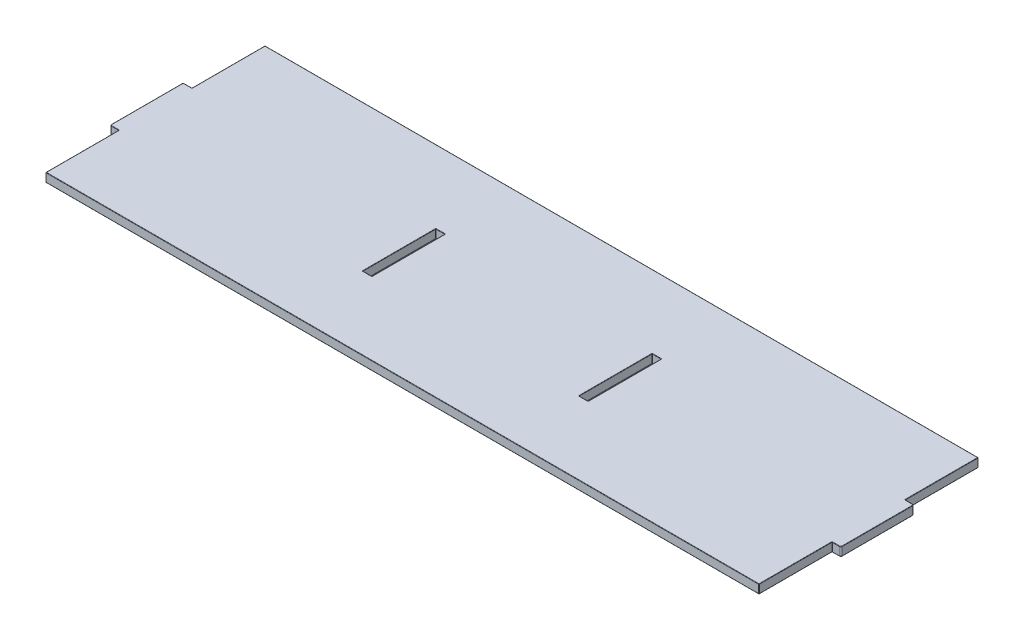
from build123d import *

# Parameters (mm, degrees)
SKETCH1_W           = 12.5
SKETCH1_H           = 100
BOSS_EXTRUDE1_DEPTH = 12
FILLET1_R           = 2
FILLET2_R           = 0.5


with BuildPart() as part:
    # Sketch1 → Boss-Extrude1 (new body)
    with BuildSketch(Plane(origin=(0, 0, 0), x_dir=(1, 0, 0), z_dir=(0, 1, 0))):
        Polygon((-488, 150), (488, 150), (488, 50), (500, 50), (500, -50), (488, -50), (488, -150), (-488, -150), (-488, -50), (-500, -50), (-500, 50), (-488, 50), align=None)
        with Locations((-148, 0)):
            Rectangle(SKETCH1_W, SKETCH1_H, mode=Mode.SUBTRACT)
        with Locations((148, 0)):
            Rectangle(SKETCH1_W, SKETCH1_H, mode=Mode.SUBTRACT)
    extrude(amount=BOSS_EXTRUDE1_DEPTH)

    # Fillet1
    fillet1_edges = [part.edges().sort_by_distance(p)[0] for p in [
        (-500, 6, 50),
        (-500, 6, -50),
        (500, 6, -50),
        (500, 6, 50),
    ]]
    fillet(fillet1_edges, radius=FILLET1_R)

    # Fillet2
    fillet2_edges = [part.edges().sort_by_distance(p)[0] for p in [
        (0, 0, 150),
        (-488, 0, 100),
        (-493, 0, -50),
        (-488, 0, -100),
        (0, 0, -150),
        (488, 0, -100),
        (493, 0, 50),
        (488, 0, 100),
        (488, 12, -100),
        (0, 12, -150),
        (488, 6, 150),
        (-488, 6, 150),
        (-488, 6, 50),
        (-488, 6, -50),
        (-488, 6, -150),
        (488, 6, -150),
        (488, 6, -50),
        (488, 6, 50),
        (-488, 12, -100),
        (-493, 12, -50),
        (-141.75, 0, 0),
        (-141.75, 6, 50),
        (-148, 0, -50),
        (-141.75, 6, -50),
        (-154.25, 0, 0),
        (-154.25, 6, -50),
        (-148, 0, 50),
        (-154.25, 6, 50),
        (-488, 12, 100),
        (-141.75, 12, 0),
        (-148, 12, -50),
        (-154.25, 12, 0),
        (-148, 12, 50),
        (0, 12, 150),
        (488, 12, 100),
        (154.25, 0, 0),
        (154.25, 6, 50),
        (148, 0, -50),
        (154.25, 6, -50),
        (141.75, 0, 0),
        (141.75, 6, -50),
        (148, 0, 50),
        (141.75, 6, 50),
        (154.25, 12, 0),
        (148, 12, -50),
        (141.75, 12, 0),
        (148, 12, 50),
        (493, 12, 50),
        (493, 0, -50),
        (493, 12, -50),
        (-493, 0, 50),
        (-500, 0, 0),
        (500, 0, 0),
        (-499.414213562, 0, -49.414213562),
        (-499.414213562, 0, 49.414213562),
        (499.414213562, 0, 49.414213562),
        (499.414213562, 0, -49.414213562),
        (500, 12, 0),
        (-500, 12, 0),
        (-493, 12, 50),
        (-499.414213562, 12, -49.414213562),
        (-499.414213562, 12, 49.414213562),
        (499.414213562, 12, 49.414213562),
        (499.414213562, 12, -49.414213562),
    ]]
    fillet(fillet2_edges, radius=FILLET2_R)


solid = part.part
